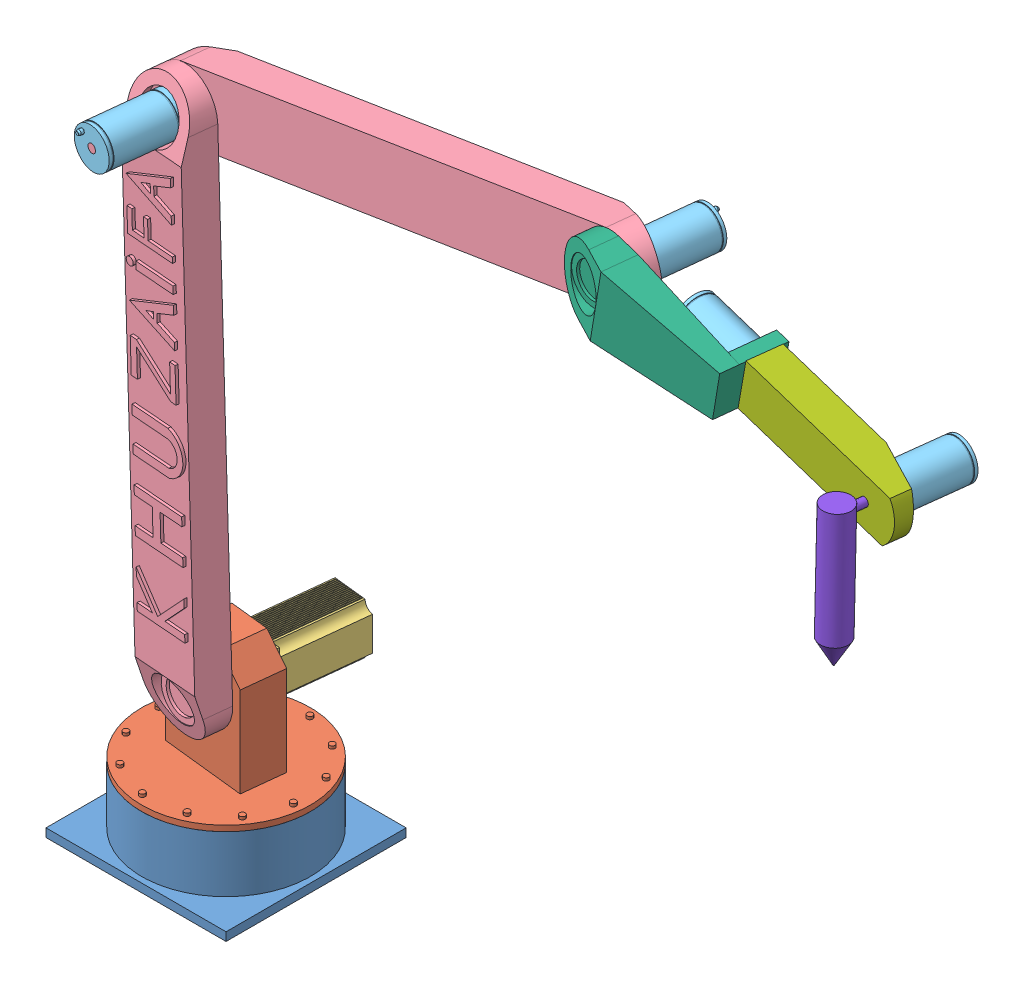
SolidWorks assembly full.SLDASM, configuration Default (file format 15000). Lengths in mm.
Overall size (3085.39 2977.87 1135.19).
12 component instances, 8 part files, 22 mates.
Components (placement in the parent):
- 1-1: 1.SLDPRT [Default] at (226.7033 175.274 547.7676) size (640 230 640)
- 2-1: 2.SLDPRT [Default] at (226.7033 395.274 547.7676) x (0.994086 0 0.108595) z (-0.108595 0 0.994086) size (600 420 600)
- 3-1: 3.SLDPRT [Default] at (237.5628 645.274 448.359) x (0.994086 0 0.108595) z (-0.108595 0 0.994086) size (180 180 342.43)
- 5-1: 5.SLDPRT [Default] at (182.2931 1524.765 678.7193) x (-0.033807 0.999422 -0.003693) z (-0.108595 0 0.994086) size (2000 240 440)
- 5-2: 5.SLDPRT [Default] at (1014.1051 2618.2737 648.8732) x (0.964239 0.243202 0.105334) z (0.108595 0 -0.994086) size (2000 240 440)
- Part6-1: Part6.SLDPRT [Default] at (125.3944 2404.2559 923.9909) x (0.75052 0.655742 0.081987) z (-0.108595 0 0.994086) size (140 140 270.86)
- 7-1: 7.SLDPRT [Default] at (2710.2833 2674.8374 954.879) x (0.978044 -0.178925 0.106842) z (-0.108595 0 0.994086) size (620 240 430)
- Part6-2: Part6.SLDPRT [Default] at (1889.7844 2832.2915 493.0459) x (-0.979839 0.168694 -0.107038) z (0.108595 0 -0.994086) size (140 140 270.86)
- 8-1: 8.SLDPRT [Default] at (1982.1729 2810.8205 734.5067) x (-0.978044 0.178925 -0.106842) z (0.106342 -0.012411 -0.994252) size (890 164 120)
- extruder-1: extruder.SLDPRT [Default] at (2827.3309 2690.3549 977.2734) x (0.994254 -0.010994 0.10648) z (-0.106342 0.012411 0.994252) size (100 500 450)
- Part6-3: Part6.SLDPRT [Default] at (2869.4374 2650.2636 579.965) x (0.975119 -0.194301 0.106721) z (0.106342 -0.012411 -0.994252) size (140 140 270.86)
- Part6-4: Part6.SLDPRT [Default] at (2089.7578 2791.1387 746.2594) x (0.142555 0.948386 0.283269) z (-0.978044 0.178925 -0.106842) size (140 140 270.86)
Mates (geometry in assembly coordinates):
- Concentric1: concentric anti-aligned: cylinder of 1-1 through (226.7033 375.274 547.7676) axis (0 -1 0) radius 300; cylinder of 2-1 through (226.7033 375.274 547.7676) axis (0 1 0) radius 300
- Coincident1: coincident anti-aligned: plane of 1-1 through (226.7033 375.274 547.7676) normal (0 1 0); plane of 2-1 through (226.7033 375.274 547.7676) normal (0 -1 0)
- Concentric2: concentric anti-aligned: cylinder of 2-1 through (218.5587 645.274 622.3241) axis (0.108595 0 -0.994086) radius 15; cylinder of 3-1 through (281.0007 645.274 50.7245) axis (-0.108595 0 0.994086) radius 15
- Coincident2: coincident anti-aligned: plane of 2-1 through (85.735 795.274 456.9219) normal (0.108595 0 -0.994086); plane of 3-1 through (234.8479 645.274 473.2111) normal (-0.108595 0 0.994086)
- Concentric3: concentric anti-aligned: cylinder of 2-1 through (218.5587 645.274 622.3241) axis (0.108595 0 -0.994086) radius 15; cylinder of 5-1 through (269.5983 645.274 155.1036) axis (-0.108595 0 0.994086) radius 15
- Coincident4: coincident anti-aligned: plane of 2-1 through (69.4458 795.274 606.0348) normal (-0.108595 0 0.994086); plane of 5-1 through (188.8088 1524.765 619.0741) normal (0.108595 0 -0.994086)
- Concentric4: concentric anti-aligned: cylinder of 5-1 through (116.4897 2404.2559 1005.506) axis (0.108595 0 -0.994086) radius 80; cylinder of Part6-1 through (152.5431 2404.2559 675.4694) axis (-0.108595 0 0.994086) radius 70
- Coincident5: coincident anti-aligned: plane of 5-1 through (152.5431 2404.2559 675.4694) normal (-0.108595 0 0.994086); plane of Part6-1 through (152.5431 2404.2559 675.4694) normal (0.108595 0 -0.994086)
- Concentric5: concentric anti-aligned: cylinder of 5-1 through (210.0983 2404.2559 148.6038) axis (-0.108595 0 0.994086) radius 15; cylinder of 5-2 through (108.0193 2404.2559 1083.0447) axis (0.108595 0 -0.994086) radius 15
- Coincident6: coincident anti-aligned: plane of 5-1 through (188.8088 1524.765 619.0741) normal (0.108595 0 -0.994086); plane of 5-2 through (1007.5894 2618.2737 708.5184) normal (-0.108595 0 0.994086)
- Concentric6: concentric anti-aligned: cylinder of 5-2 through (1898.6892 2832.2915 411.5308) axis (-0.108595 0 0.994086) radius 80; cylinder of Part6-2 through (1862.6357 2832.2915 741.5674) axis (0.108595 0 -0.994086) radius 70
- Coincident7: coincident anti-aligned: plane of 5-2 through (1862.6357 2832.2915 741.5674) normal (0.108595 0 -0.994086); plane of Part6-2 through (1862.6357 2832.2915 741.5674) normal (-0.108595 0 0.994086)
- Concentric7: concentric anti-aligned: cylinder of 5-2 through (1805.0805 2832.2915 1268.433) axis (0.108595 0 -0.994086) radius 15; cylinder of 7-1 through (1907.1596 2832.2915 333.9921) axis (-0.108595 0 0.994086) radius 15
- Coincident8: coincident anti-aligned: plane of 5-2 through (1007.5894 2618.2737 708.5184) normal (-0.108595 0 0.994086); plane of 7-1 through (2716.7989 2674.8374 895.2338) normal (0.108595 0 -0.994086)
- Concentric8: concentric aligned: cylinder of 7-1 through (2273.2719 2757.5663 766.3066) axis (-0.978044 0.178925 -0.106842) radius 70; cylinder of Part6-4 through (2334.2688 2746.4074 772.97) axis (-0.978044 0.178925 -0.106842) radius 70
- Coincident9: coincident anti-aligned: plane of 7-1 through (2334.2688 2746.4074 772.97) normal (-0.978044 0.178925 -0.106842); plane of Part6-4 through (2334.2688 2746.4074 772.97) normal (0.978044 -0.178925 0.106842)
- Concentric9: concentric aligned: cylinder of 7-1 through (2213.9694 2768.4152 759.8284) axis (0.978044 -0.178925 0.106842) radius 15; cylinder of 8-1 through (2353.8297 2742.8289 775.1068) axis (0.978044 -0.178925 0.106842) radius 15
- Coincident10: coincident anti-aligned: plane of 7-1 through (2256.8658 2404.3802 1095.9351) normal (0.978044 -0.178925 0.106842); plane of 8-1 through (2312.3248 2402.0557 584.3655) normal (-0.978044 0.178925 -0.106842)
- Concentric10: concentric anti-aligned: cylinder of 8-1 through (2878.1575 2649.2458 498.4363) axis (-0.106342 0.012411 0.994252) radius 80; cylinder of Part6-3 through (2842.8518 2653.3664 828.528) axis (0.106342 -0.012411 -0.994252) radius 70
- Coincident11: coincident anti-aligned: plane of 8-1 through (2842.8518 2653.3664 828.528) normal (0.106342 -0.012411 -0.994252); plane of Part6-3 through (2842.8518 2653.3664 828.528) normal (-0.106342 0.012411 0.994252)
- Concentric11: concentric anti-aligned: cylinder of 8-1 through (2800.4212 2658.3185 1225.2346) axis (0.106342 -0.012411 -0.994252) radius 15; cylinder of extruder-1 through (2869.4374 2650.2636 579.965) axis (-0.106342 0.012411 0.994252) radius 15
- Coincident12: coincident aligned: plane of extruder-1 through (2869.4374 2650.2636 579.965) normal (0.106342 -0.012411 -0.994252); plane of Part6-3 through (2869.4374 2650.2636 579.965) normal (0.106342 -0.012411 -0.994252)
